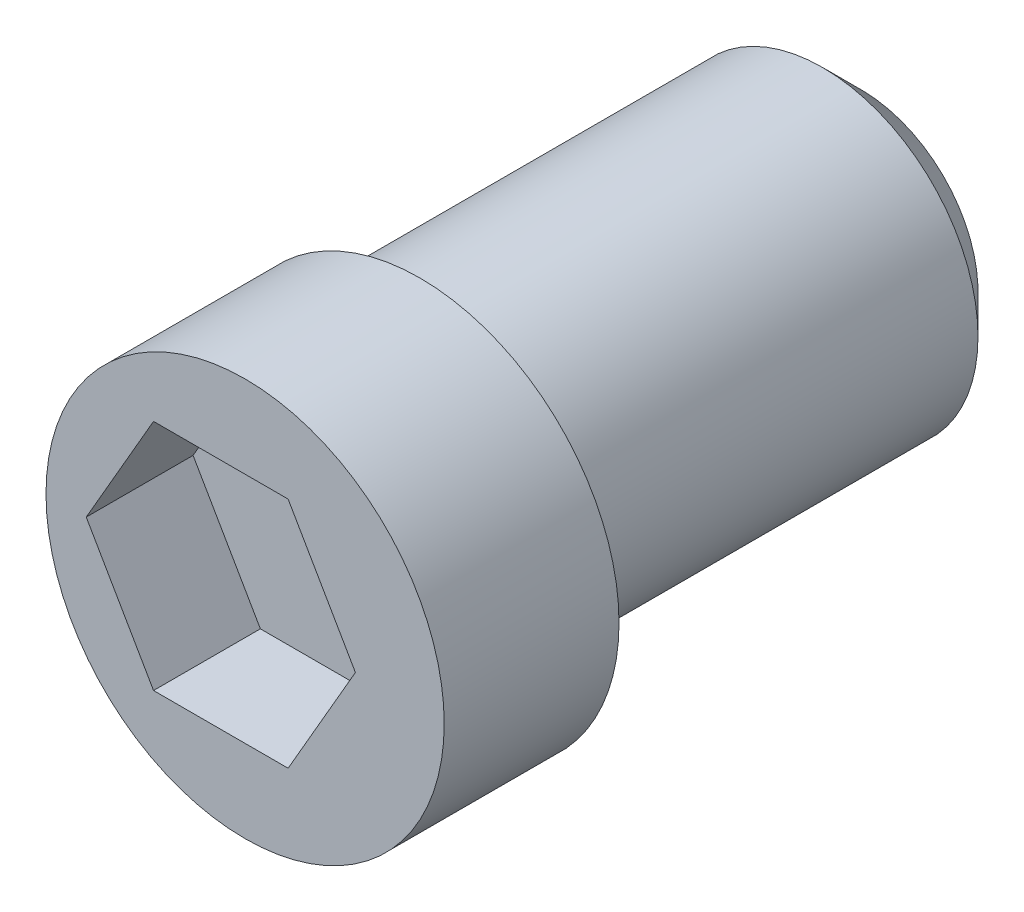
ISO-10303-21;
HEADER;
FILE_DESCRIPTION(('STEP AP214'),'2;1');
FILE_NAME('part.step','',(''),(''),'','','');
FILE_SCHEMA(('AUTOMOTIVE_DESIGN { 1 0 10303 214 1 1 1 1 }'));
ENDSEC;
DATA;
#1=APPLICATION_CONTEXT('core data for automotive mechanical design processes');
#2=APPLICATION_PROTOCOL_DEFINITION('international standard','automotive_design',2000,#1);
#3=PRODUCT_CONTEXT('',#1,'mechanical');
#4=PRODUCT('Part','Part','',(#3));
#5=PRODUCT_RELATED_PRODUCT_CATEGORY('part','',(#4));
#6=PRODUCT_DEFINITION_FORMATION('','',#4);
#7=PRODUCT_DEFINITION_CONTEXT('part definition',#1,'design');
#8=PRODUCT_DEFINITION('design','',#6,#7);
#9=PRODUCT_DEFINITION_SHAPE('','',#8);
#10=(LENGTH_UNIT() NAMED_UNIT(*) SI_UNIT(.MILLI.,.METRE.));
#11=(NAMED_UNIT(*) PLANE_ANGLE_UNIT() SI_UNIT($,.RADIAN.));
#12=(NAMED_UNIT(*) SI_UNIT($,.STERADIAN.) SOLID_ANGLE_UNIT());
#13=UNCERTAINTY_MEASURE_WITH_UNIT(LENGTH_MEASURE(1.E-05),#10,'distance_accuracy_value','');
#14=(GEOMETRIC_REPRESENTATION_CONTEXT(3) GLOBAL_UNCERTAINTY_ASSIGNED_CONTEXT((#13)) GLOBAL_UNIT_ASSIGNED_CONTEXT((#10,
#11,#12)) REPRESENTATION_CONTEXT('',''));
#15=CARTESIAN_POINT('',(0.,0.,0.));
#16=DIRECTION('',(0.,0.,1.));
#17=DIRECTION('',(1.,0.,0.));
#18=AXIS2_PLACEMENT_3D('',#15,#16,#17);
#19=CARTESIAN_POINT('',(0.,0.,-30.));
#20=DIRECTION('',(0.,0.,1.));
#21=DIRECTION('',(1.,0.,0.));
#22=AXIS2_PLACEMENT_3D('',#19,#20,#21);
#23=CYLINDRICAL_SURFACE('',#22,8.);
#24=CARTESIAN_POINT('',(0.,0.,-22.));
#25=DIRECTION('',(0.,0.,-1.));
#26=DIRECTION('',(-1.,0.,0.));
#27=AXIS2_PLACEMENT_3D('',#24,#25,#26);
#28=CIRCLE('',#27,8.);
#29=CARTESIAN_POINT('',(-8.,0.,-22.));
#30=VERTEX_POINT('',#29);
#31=EDGE_CURVE('E9',#30,#30,#28,.F.);
#32=ORIENTED_EDGE('',*,*,#31,.T.);
#33=EDGE_LOOP('',(#32));
#34=FACE_BOUND('',#33,.T.);
#35=CARTESIAN_POINT('',(0.,0.,0.));
#36=DIRECTION('',(0.,0.,1.));
#37=DIRECTION('',(1.,0.,0.));
#38=AXIS2_PLACEMENT_3D('',#35,#36,#37);
#39=CIRCLE('',#38,8.);
#40=CARTESIAN_POINT('',(8.,0.,0.));
#41=VERTEX_POINT('',#40);
#42=EDGE_CURVE('E117',#41,#41,#39,.F.);
#43=ORIENTED_EDGE('',*,*,#42,.T.);
#44=EDGE_LOOP('',(#43));
#45=FACE_BOUND('',#44,.T.);
#46=ADVANCED_FACE('F14',(#34,#45),#23,.T.);
#47=CARTESIAN_POINT('',(0.,-7.9375,0.));
#48=DIRECTION('',(0.,0.,1.));
#49=DIRECTION('',(-1.,0.,0.));
#50=AXIS2_PLACEMENT_3D('',#47,#48,#49);
#51=PLANE('',#50);
#52=ORIENTED_EDGE('',*,*,#42,.F.);
#53=EDGE_LOOP('',(#52));
#54=FACE_BOUND('',#53,.T.);
#55=CARTESIAN_POINT('',(1.27,0.,0.));
#56=DIRECTION('',(0.,0.,1.));
#57=DIRECTION('',(1.,0.,0.));
#58=AXIS2_PLACEMENT_3D('',#55,#56,#57);
#59=CIRCLE('',#58,10.25);
#60=CARTESIAN_POINT('',(11.52,0.,0.));
#61=VERTEX_POINT('',#60);
#62=EDGE_CURVE('E104',#61,#61,#59,.T.);
#63=ORIENTED_EDGE('',*,*,#62,.F.);
#64=EDGE_LOOP('',(#63));
#65=FACE_BOUND('',#64,.T.);
#66=ADVANCED_FACE('F140',(#54,#65),#51,.F.);
#67=CARTESIAN_POINT('',(1.27,0.,-1.));
#68=DIRECTION('',(0.,0.,1.));
#69=DIRECTION('',(1.,0.,0.));
#70=AXIS2_PLACEMENT_3D('',#67,#68,#69);
#71=CYLINDRICAL_SURFACE('',#70,10.25);
#72=CARTESIAN_POINT('',(1.27,0.,9.));
#73=DIRECTION('',(0.,0.,1.));
#74=DIRECTION('',(1.,0.,0.));
#75=AXIS2_PLACEMENT_3D('',#72,#73,#74);
#76=CIRCLE('',#75,10.25);
#77=CARTESIAN_POINT('',(11.52,0.,9.));
#78=VERTEX_POINT('',#77);
#79=EDGE_CURVE('E182',#78,#78,#76,.T.);
#80=ORIENTED_EDGE('',*,*,#79,.F.);
#81=EDGE_LOOP('',(#80));
#82=FACE_BOUND('',#81,.T.);
#83=ORIENTED_EDGE('',*,*,#62,.T.);
#84=EDGE_LOOP('',(#83));
#85=FACE_BOUND('',#84,.T.);
#86=ADVANCED_FACE('F147',(#82,#85),#71,.T.);
#87=CARTESIAN_POINT('',(0.02,0.,3.5));
#88=DIRECTION('',(0.,0.,1.));
#89=DIRECTION('',(1.,0.,0.));
#90=AXIS2_PLACEMENT_3D('',#87,#88,#89);
#91=PLANE('',#90);
#92=DIRECTION('',(-0.5,-0.866025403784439,0.));
#93=VECTOR('',#92,1.);
#94=CARTESIAN_POINT('',(-3.44410161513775,6.,3.5));
#95=LINE('',#94,#93);
#96=CARTESIAN_POINT('',(-3.44410161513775,6.,3.5));
#97=VERTEX_POINT('',#96);
#98=CARTESIAN_POINT('',(-6.90820323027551,0.,3.5));
#99=VERTEX_POINT('',#98);
#100=EDGE_CURVE('E115',#97,#99,#95,.T.);
#101=ORIENTED_EDGE('',*,*,#100,.T.);
#102=DIRECTION('',(0.5,-0.866025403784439,0.));
#103=VECTOR('',#102,1.);
#104=CARTESIAN_POINT('',(-6.90820323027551,0.,3.5));
#105=LINE('',#104,#103);
#106=CARTESIAN_POINT('',(-3.44410161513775,-6.,3.5));
#107=VERTEX_POINT('',#106);
#108=EDGE_CURVE('E97',#99,#107,#105,.T.);
#109=ORIENTED_EDGE('',*,*,#108,.T.);
#110=DIRECTION('',(1.,0.,0.));
#111=VECTOR('',#110,1.);
#112=CARTESIAN_POINT('',(-3.44410161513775,-6.,3.5));
#113=LINE('',#112,#111);
#114=CARTESIAN_POINT('',(3.48410161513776,-6.,3.5));
#115=VERTEX_POINT('',#114);
#116=EDGE_CURVE('E95',#107,#115,#113,.T.);
#117=ORIENTED_EDGE('',*,*,#116,.T.);
#118=DIRECTION('',(0.5,0.866025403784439,0.));
#119=VECTOR('',#118,1.);
#120=CARTESIAN_POINT('',(3.48410161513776,-6.,3.5));
#121=LINE('',#120,#119);
#122=CARTESIAN_POINT('',(6.94820323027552,0.,3.5));
#123=VERTEX_POINT('',#122);
#124=EDGE_CURVE('E74',#115,#123,#121,.T.);
#125=ORIENTED_EDGE('',*,*,#124,.T.);
#126=DIRECTION('',(-0.5,0.866025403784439,0.));
#127=VECTOR('',#126,1.);
#128=CARTESIAN_POINT('',(6.94820323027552,0.,3.5));
#129=LINE('',#128,#127);
#130=CARTESIAN_POINT('',(3.48410161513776,6.,3.5));
#131=VERTEX_POINT('',#130);
#132=EDGE_CURVE('E85',#123,#131,#129,.T.);
#133=ORIENTED_EDGE('',*,*,#132,.T.);
#134=DIRECTION('',(-1.,0.,0.));
#135=VECTOR('',#134,1.);
#136=CARTESIAN_POINT('',(3.48410161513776,6.,3.5));
#137=LINE('',#136,#135);
#138=EDGE_CURVE('E89',#131,#97,#137,.T.);
#139=ORIENTED_EDGE('',*,*,#138,.T.);
#140=EDGE_LOOP('',(#101,#109,#117,#125,#133,#139));
#141=FACE_BOUND('',#140,.T.);
#142=ADVANCED_FACE('F92',(#141),#91,.T.);
#143=CARTESIAN_POINT('',(-3.44410161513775,-6.,3.5));
#144=DIRECTION('',(0.,-1.,0.));
#145=DIRECTION('',(0.,0.,-1.));
#146=AXIS2_PLACEMENT_3D('',#143,#144,#145);
#147=PLANE('',#146);
#148=DIRECTION('',(1.,0.,0.));
#149=VECTOR('',#148,1.);
#150=CARTESIAN_POINT('',(-3.44410161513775,-6.,9.));
#151=LINE('',#150,#149);
#152=CARTESIAN_POINT('',(-3.44410161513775,-6.,9.));
#153=VERTEX_POINT('',#152);
#154=CARTESIAN_POINT('',(3.48410161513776,-6.,9.));
#155=VERTEX_POINT('',#154);
#156=EDGE_CURVE('E107',#153,#155,#151,.T.);
#157=ORIENTED_EDGE('',*,*,#156,.T.);
#158=DIRECTION('',(0.,0.,1.));
#159=VECTOR('',#158,1.);
#160=CARTESIAN_POINT('',(3.48410161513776,-6.,3.5));
#161=LINE('',#160,#159);
#162=EDGE_CURVE('E82',#115,#155,#161,.T.);
#163=ORIENTED_EDGE('',*,*,#162,.F.);
#164=ORIENTED_EDGE('',*,*,#116,.F.);
#165=DIRECTION('',(0.,0.,1.));
#166=VECTOR('',#165,1.);
#167=CARTESIAN_POINT('',(-3.44410161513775,-6.,3.5));
#168=LINE('',#167,#166);
#169=EDGE_CURVE('E120',#107,#153,#168,.T.);
#170=ORIENTED_EDGE('',*,*,#169,.T.);
#171=EDGE_LOOP('',(#157,#163,#164,#170));
#172=FACE_BOUND('',#171,.T.);
#173=ADVANCED_FACE('F154',(#172),#147,.F.);
#174=CARTESIAN_POINT('',(3.48410161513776,-6.,3.5));
#175=DIRECTION('',(0.866025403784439,-0.5,0.));
#176=DIRECTION('',(0.5,0.866025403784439,0.));
#177=AXIS2_PLACEMENT_3D('',#174,#175,#176);
#178=PLANE('',#177);
#179=DIRECTION('',(0.5,0.866025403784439,0.));
#180=VECTOR('',#179,1.);
#181=CARTESIAN_POINT('',(3.48410161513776,-6.,9.));
#182=LINE('',#181,#180);
#183=CARTESIAN_POINT('',(6.94820323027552,0.,9.));
#184=VERTEX_POINT('',#183);
#185=EDGE_CURVE('E77',#155,#184,#182,.T.);
#186=ORIENTED_EDGE('',*,*,#185,.T.);
#187=DIRECTION('',(0.,0.,1.));
#188=VECTOR('',#187,1.);
#189=CARTESIAN_POINT('',(6.94820323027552,0.,3.5));
#190=LINE('',#189,#188);
#191=EDGE_CURVE('E70',#123,#184,#190,.T.);
#192=ORIENTED_EDGE('',*,*,#191,.F.);
#193=ORIENTED_EDGE('',*,*,#124,.F.);
#194=ORIENTED_EDGE('',*,*,#162,.T.);
#195=EDGE_LOOP('',(#186,#192,#193,#194));
#196=FACE_BOUND('',#195,.T.);
#197=ADVANCED_FACE('F72',(#196),#178,.F.);
#198=CARTESIAN_POINT('',(6.94820323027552,0.,3.5));
#199=DIRECTION('',(0.866025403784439,0.5,0.));
#200=DIRECTION('',(-0.5,0.866025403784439,0.));
#201=AXIS2_PLACEMENT_3D('',#198,#199,#200);
#202=PLANE('',#201);
#203=DIRECTION('',(-0.5,0.866025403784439,0.));
#204=VECTOR('',#203,1.);
#205=CARTESIAN_POINT('',(6.94820323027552,0.,9.));
#206=LINE('',#205,#204);
#207=CARTESIAN_POINT('',(3.48410161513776,6.,9.));
#208=VERTEX_POINT('',#207);
#209=EDGE_CURVE('E111',#184,#208,#206,.T.);
#210=ORIENTED_EDGE('',*,*,#209,.T.);
#211=DIRECTION('',(0.,0.,1.));
#212=VECTOR('',#211,1.);
#213=CARTESIAN_POINT('',(3.48410161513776,6.,3.5));
#214=LINE('',#213,#212);
#215=EDGE_CURVE('E81',#131,#208,#214,.T.);
#216=ORIENTED_EDGE('',*,*,#215,.F.);
#217=ORIENTED_EDGE('',*,*,#132,.F.);
#218=ORIENTED_EDGE('',*,*,#191,.T.);
#219=EDGE_LOOP('',(#210,#216,#217,#218));
#220=FACE_BOUND('',#219,.T.);
#221=ADVANCED_FACE('F86',(#220),#202,.F.);
#222=CARTESIAN_POINT('',(3.48410161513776,6.,3.5));
#223=DIRECTION('',(0.,1.,0.));
#224=DIRECTION('',(0.,0.,1.));
#225=AXIS2_PLACEMENT_3D('',#222,#223,#224);
#226=PLANE('',#225);
#227=DIRECTION('',(-1.,0.,0.));
#228=VECTOR('',#227,1.);
#229=CARTESIAN_POINT('',(3.48410161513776,6.,9.));
#230=LINE('',#229,#228);
#231=CARTESIAN_POINT('',(-3.44410161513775,6.,9.));
#232=VERTEX_POINT('',#231);
#233=EDGE_CURVE('E113',#208,#232,#230,.T.);
#234=ORIENTED_EDGE('',*,*,#233,.T.);
#235=DIRECTION('',(0.,0.,1.));
#236=VECTOR('',#235,1.);
#237=CARTESIAN_POINT('',(-3.44410161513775,6.,3.5));
#238=LINE('',#237,#236);
#239=EDGE_CURVE('E37',#97,#232,#238,.T.);
#240=ORIENTED_EDGE('',*,*,#239,.F.);
#241=ORIENTED_EDGE('',*,*,#138,.F.);
#242=ORIENTED_EDGE('',*,*,#215,.T.);
#243=EDGE_LOOP('',(#234,#240,#241,#242));
#244=FACE_BOUND('',#243,.T.);
#245=ADVANCED_FACE('F155',(#244),#226,.F.);
#246=CARTESIAN_POINT('',(-3.44410161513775,6.,3.5));
#247=DIRECTION('',(-0.866025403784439,0.5,0.));
#248=DIRECTION('',(-0.5,-0.866025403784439,0.));
#249=AXIS2_PLACEMENT_3D('',#246,#247,#248);
#250=PLANE('',#249);
#251=DIRECTION('',(-0.5,-0.866025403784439,0.));
#252=VECTOR('',#251,1.);
#253=CARTESIAN_POINT('',(-3.44410161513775,6.,9.));
#254=LINE('',#253,#252);
#255=CARTESIAN_POINT('',(-6.90820323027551,0.,9.));
#256=VERTEX_POINT('',#255);
#257=EDGE_CURVE('E29',#232,#256,#254,.T.);
#258=ORIENTED_EDGE('',*,*,#257,.T.);
#259=DIRECTION('',(0.,0.,1.));
#260=VECTOR('',#259,1.);
#261=CARTESIAN_POINT('',(-6.90820323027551,0.,3.5));
#262=LINE('',#261,#260);
#263=EDGE_CURVE('E59',#99,#256,#262,.T.);
#264=ORIENTED_EDGE('',*,*,#263,.F.);
#265=ORIENTED_EDGE('',*,*,#100,.F.);
#266=ORIENTED_EDGE('',*,*,#239,.T.);
#267=EDGE_LOOP('',(#258,#264,#265,#266));
#268=FACE_BOUND('',#267,.T.);
#269=ADVANCED_FACE('F158',(#268),#250,.F.);
#270=CARTESIAN_POINT('',(-6.90820323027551,0.,3.5));
#271=DIRECTION('',(-0.866025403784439,-0.5,0.));
#272=DIRECTION('',(0.5,-0.866025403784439,0.));
#273=AXIS2_PLACEMENT_3D('',#270,#271,#272);
#274=PLANE('',#273);
#275=DIRECTION('',(0.5,-0.866025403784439,0.));
#276=VECTOR('',#275,1.);
#277=CARTESIAN_POINT('',(-6.90820323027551,0.,9.));
#278=LINE('',#277,#276);
#279=EDGE_CURVE('E103',#256,#153,#278,.T.);
#280=ORIENTED_EDGE('',*,*,#279,.T.);
#281=ORIENTED_EDGE('',*,*,#169,.F.);
#282=ORIENTED_EDGE('',*,*,#108,.F.);
#283=ORIENTED_EDGE('',*,*,#263,.T.);
#284=EDGE_LOOP('',(#280,#281,#282,#283));
#285=FACE_BOUND('',#284,.T.);
#286=ADVANCED_FACE('F166',(#285),#274,.F.);
#287=CARTESIAN_POINT('',(1.27,0.,9.));
#288=DIRECTION('',(0.,0.,-1.));
#289=DIRECTION('',(1.,0.,0.));
#290=AXIS2_PLACEMENT_3D('',#287,#288,#289);
#291=PLANE('',#290);
#292=ORIENTED_EDGE('',*,*,#279,.F.);
#293=ORIENTED_EDGE('',*,*,#257,.F.);
#294=ORIENTED_EDGE('',*,*,#233,.F.);
#295=ORIENTED_EDGE('',*,*,#209,.F.);
#296=ORIENTED_EDGE('',*,*,#185,.F.);
#297=ORIENTED_EDGE('',*,*,#156,.F.);
#298=EDGE_LOOP('',(#292,#293,#294,#295,#296,#297));
#299=FACE_BOUND('',#298,.T.);
#300=ORIENTED_EDGE('',*,*,#79,.T.);
#301=EDGE_LOOP('',(#300));
#302=FACE_BOUND('',#301,.T.);
#303=ADVANCED_FACE('F136',(#299,#302),#291,.F.);
#304=CARTESIAN_POINT('',(0.,0.,-24.));
#305=DIRECTION('',(0.,0.,-1.));
#306=DIRECTION('',(-1.,0.,0.));
#307=AXIS2_PLACEMENT_3D('',#304,#305,#306);
#308=PLANE('',#307);
#309=CARTESIAN_POINT('',(0.,0.,-24.));
#310=DIRECTION('',(0.,0.,-1.));
#311=DIRECTION('',(-1.,0.,0.));
#312=AXIS2_PLACEMENT_3D('',#309,#310,#311);
#313=CIRCLE('',#312,6.);
#314=CARTESIAN_POINT('',(-6.,0.,-24.));
#315=VERTEX_POINT('',#314);
#316=EDGE_CURVE('E22',#315,#315,#313,.T.);
#317=ORIENTED_EDGE('',*,*,#316,.T.);
#318=EDGE_LOOP('',(#317));
#319=FACE_BOUND('',#318,.T.);
#320=ADVANCED_FACE('F127',(#319),#308,.T.);
#321=CARTESIAN_POINT('',(0.,0.,-24.));
#322=DIRECTION('',(0.,0.,1.));
#323=DIRECTION('',(1.,0.,0.));
#324=AXIS2_PLACEMENT_3D('',#321,#322,#323);
#325=CONICAL_SURFACE('',#324,6.,0.785398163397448);
#326=ORIENTED_EDGE('',*,*,#31,.F.);
#327=EDGE_LOOP('',(#326));
#328=FACE_BOUND('',#327,.T.);
#329=ORIENTED_EDGE('',*,*,#316,.F.);
#330=EDGE_LOOP('',(#329));
#331=FACE_BOUND('',#330,.T.);
#332=ADVANCED_FACE('F16',(#328,#331),#325,.T.);
#333=CLOSED_SHELL('',(#46,#66,#86,#142,#173,#197,#221,#245,#269,#286,#303,#320,#332));
#334=MANIFOLD_SOLID_BREP('B1',#333);
#335=ADVANCED_BREP_SHAPE_REPRESENTATION('',(#18,#334),#14);
#336=SHAPE_DEFINITION_REPRESENTATION(#9,#335);
ENDSEC;
END-ISO-10303-21;
